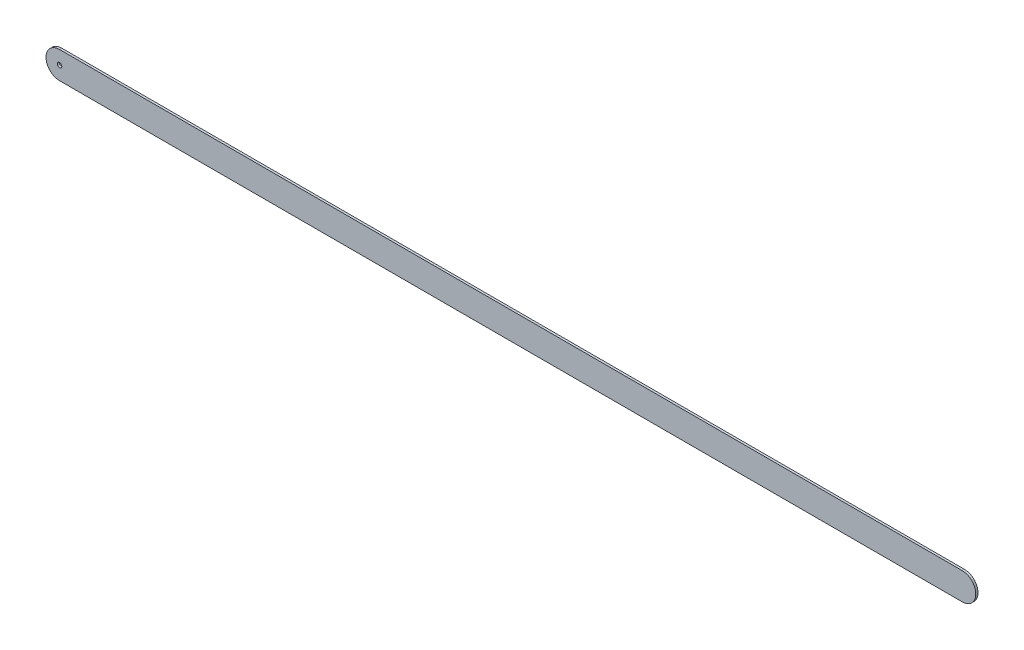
from build123d import *

# Parameters (mm, degrees)
SKETCH1_R           = 1
BOSS_EXTRUDE1_DEPTH = 1


with BuildPart() as part:
    # Sketch1 → Boss-Extrude1 (new body)
    with BuildSketch(Plane.XY):
        with BuildLine():
            Line((0, 6), (400, 6))
            ThreePointArc((400, 6), (406, 0), (400, -6))
            Line((400, -6), (0, -6))
            ThreePointArc((0, -6), (-6, 0), (0, 6))
        make_face()
        Circle(SKETCH1_R, mode=Mode.SUBTRACT)
    extrude(amount=BOSS_EXTRUDE1_DEPTH)


solid = part.part
